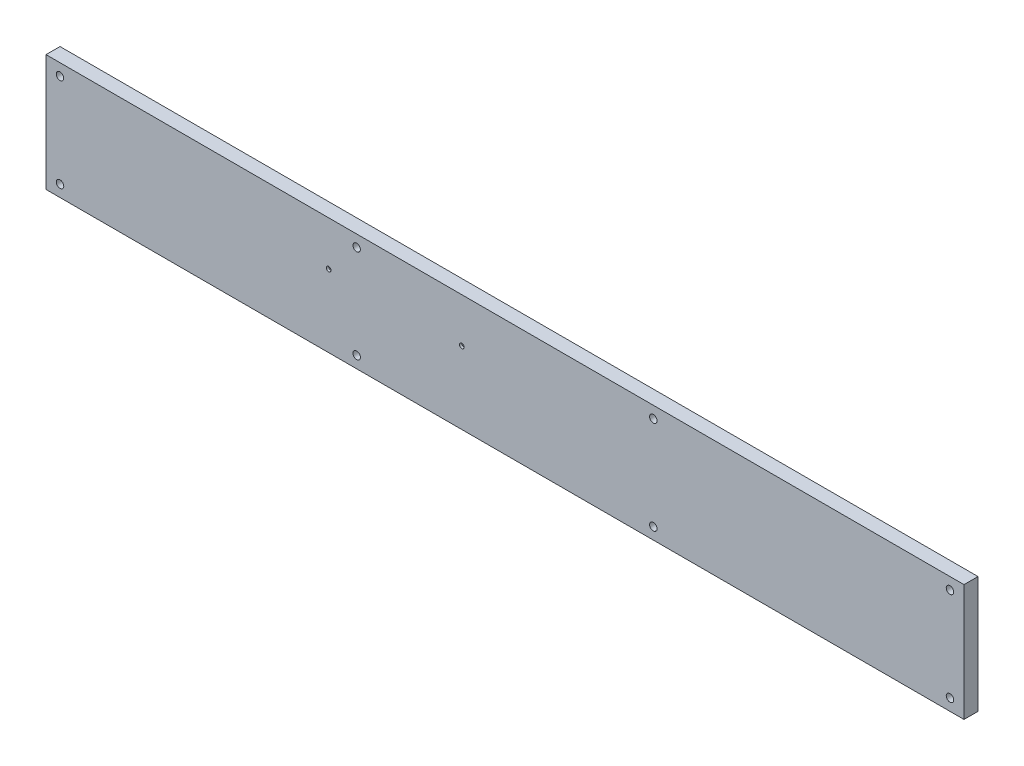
ISO-10303-21;
HEADER;
FILE_DESCRIPTION(('STEP AP214'),'2;1');
FILE_NAME('part.step','',(''),(''),'','','');
FILE_SCHEMA(('AUTOMOTIVE_DESIGN { 1 0 10303 214 1 1 1 1 }'));
ENDSEC;
DATA;
#1=APPLICATION_CONTEXT('core data for automotive mechanical design processes');
#2=APPLICATION_PROTOCOL_DEFINITION('international standard','automotive_design',2000,#1);
#3=PRODUCT_CONTEXT('',#1,'mechanical');
#4=PRODUCT('Part','Part','',(#3));
#5=PRODUCT_RELATED_PRODUCT_CATEGORY('part','',(#4));
#6=PRODUCT_DEFINITION_FORMATION('','',#4);
#7=PRODUCT_DEFINITION_CONTEXT('part definition',#1,'design');
#8=PRODUCT_DEFINITION('design','',#6,#7);
#9=PRODUCT_DEFINITION_SHAPE('','',#8);
#10=(LENGTH_UNIT() NAMED_UNIT(*) SI_UNIT(.MILLI.,.METRE.));
#11=(NAMED_UNIT(*) PLANE_ANGLE_UNIT() SI_UNIT($,.RADIAN.));
#12=(NAMED_UNIT(*) SI_UNIT($,.STERADIAN.) SOLID_ANGLE_UNIT());
#13=UNCERTAINTY_MEASURE_WITH_UNIT(LENGTH_MEASURE(1.E-05),#10,'distance_accuracy_value','');
#14=(GEOMETRIC_REPRESENTATION_CONTEXT(3) GLOBAL_UNCERTAINTY_ASSIGNED_CONTEXT((#13)) GLOBAL_UNIT_ASSIGNED_CONTEXT((#10,
#11,#12)) REPRESENTATION_CONTEXT('',''));
#15=CARTESIAN_POINT('',(0.,0.,0.));
#16=DIRECTION('',(0.,0.,1.));
#17=DIRECTION('',(1.,0.,0.));
#18=AXIS2_PLACEMENT_3D('',#15,#16,#17);
#19=CARTESIAN_POINT('',(0.,49.9999999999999,6.));
#20=DIRECTION('',(0.,0.,-1.));
#21=DIRECTION('',(-1.,0.,0.));
#22=AXIS2_PLACEMENT_3D('',#19,#20,#21);
#23=PLANE('',#22);
#24=CARTESIAN_POINT('',(178.,31.,6.));
#25=DIRECTION('',(0.,0.,1.));
#26=DIRECTION('',(1.,0.,0.));
#27=AXIS2_PLACEMENT_3D('',#24,#25,#26);
#28=CIRCLE('',#27,0.999999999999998);
#29=CARTESIAN_POINT('',(179.,31.,6.));
#30=VERTEX_POINT('',#29);
#31=EDGE_CURVE('E324',#30,#30,#28,.T.);
#32=ORIENTED_EDGE('',*,*,#31,.F.);
#33=EDGE_LOOP('',(#32));
#34=FACE_BOUND('',#33,.T.);
#35=CARTESIAN_POINT('',(121.,31.,6.));
#36=DIRECTION('',(0.,0.,1.));
#37=DIRECTION('',(1.,0.,0.));
#38=AXIS2_PLACEMENT_3D('',#35,#36,#37);
#39=CIRCLE('',#38,0.999999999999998);
#40=CARTESIAN_POINT('',(122.,31.,6.));
#41=VERTEX_POINT('',#40);
#42=EDGE_CURVE('E323',#41,#41,#39,.T.);
#43=ORIENTED_EDGE('',*,*,#42,.F.);
#44=EDGE_LOOP('',(#43));
#45=FACE_BOUND('',#44,.T.);
#46=CARTESIAN_POINT('',(260.,45.,6.));
#47=DIRECTION('',(0.,0.,1.));
#48=DIRECTION('',(-1.,0.,0.));
#49=AXIS2_PLACEMENT_3D('',#46,#47,#48);
#50=CIRCLE('',#49,1.60000000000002);
#51=CARTESIAN_POINT('',(258.4,45.,6.));
#52=VERTEX_POINT('',#51);
#53=EDGE_CURVE('E131',#52,#52,#50,.T.);
#54=ORIENTED_EDGE('',*,*,#53,.F.);
#55=EDGE_LOOP('',(#54));
#56=FACE_BOUND('',#55,.T.);
#57=CARTESIAN_POINT('',(387.,5.,6.));
#58=DIRECTION('',(0.,0.,1.));
#59=DIRECTION('',(1.,0.,0.));
#60=AXIS2_PLACEMENT_3D('',#57,#58,#59);
#61=CIRCLE('',#60,1.60000000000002);
#62=CARTESIAN_POINT('',(388.6,5.,6.));
#63=VERTEX_POINT('',#62);
#64=EDGE_CURVE('E147',#63,#63,#61,.T.);
#65=ORIENTED_EDGE('',*,*,#64,.F.);
#66=EDGE_LOOP('',(#65));
#67=FACE_BOUND('',#66,.T.);
#68=CARTESIAN_POINT('',(6.,5.,6.));
#69=DIRECTION('',(0.,0.,1.));
#70=DIRECTION('',(1.,0.,0.));
#71=AXIS2_PLACEMENT_3D('',#68,#69,#70);
#72=CIRCLE('',#71,1.6);
#73=CARTESIAN_POINT('',(7.6,5.,6.));
#74=VERTEX_POINT('',#73);
#75=EDGE_CURVE('E157',#74,#74,#72,.T.);
#76=ORIENTED_EDGE('',*,*,#75,.F.);
#77=EDGE_LOOP('',(#76));
#78=FACE_BOUND('',#77,.T.);
#79=CARTESIAN_POINT('',(6.,45.,6.));
#80=DIRECTION('',(0.,0.,1.));
#81=DIRECTION('',(-1.,0.,0.));
#82=AXIS2_PLACEMENT_3D('',#79,#80,#81);
#83=CIRCLE('',#82,1.6);
#84=CARTESIAN_POINT('',(4.4,45.,6.));
#85=VERTEX_POINT('',#84);
#86=EDGE_CURVE('E85',#85,#85,#83,.T.);
#87=ORIENTED_EDGE('',*,*,#86,.F.);
#88=EDGE_LOOP('',(#87));
#89=FACE_BOUND('',#88,.T.);
#90=DIRECTION('',(0.,-1.,0.));
#91=VECTOR('',#90,1.);
#92=CARTESIAN_POINT('',(0.,0.,6.));
#93=LINE('',#92,#91);
#94=CARTESIAN_POINT('',(0.,49.9999999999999,6.));
#95=VERTEX_POINT('',#94);
#96=CARTESIAN_POINT('',(0.,0.,6.));
#97=VERTEX_POINT('',#96);
#98=EDGE_CURVE('E95',#95,#97,#93,.T.);
#99=ORIENTED_EDGE('',*,*,#98,.T.);
#100=DIRECTION('',(1.,0.,0.));
#101=VECTOR('',#100,1.);
#102=CARTESIAN_POINT('',(0.,0.,6.));
#103=LINE('',#102,#101);
#104=CARTESIAN_POINT('',(393.,0.,6.));
#105=VERTEX_POINT('',#104);
#106=EDGE_CURVE('E80',#97,#105,#103,.T.);
#107=ORIENTED_EDGE('',*,*,#106,.T.);
#108=DIRECTION('',(0.,1.,0.));
#109=VECTOR('',#108,1.);
#110=CARTESIAN_POINT('',(393.,0.,6.));
#111=LINE('',#110,#109);
#112=CARTESIAN_POINT('',(393.,49.9999999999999,6.));
#113=VERTEX_POINT('',#112);
#114=EDGE_CURVE('E46',#105,#113,#111,.T.);
#115=ORIENTED_EDGE('',*,*,#114,.T.);
#116=DIRECTION('',(-1.,0.,0.));
#117=VECTOR('',#116,1.);
#118=CARTESIAN_POINT('',(0.,49.9999999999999,6.));
#119=LINE('',#118,#117);
#120=EDGE_CURVE('E41',#113,#95,#119,.T.);
#121=ORIENTED_EDGE('',*,*,#120,.T.);
#122=EDGE_LOOP('',(#99,#107,#115,#121));
#123=FACE_BOUND('',#122,.T.);
#124=CARTESIAN_POINT('',(133.,5.,6.));
#125=DIRECTION('',(0.,0.,1.));
#126=DIRECTION('',(1.,0.,0.));
#127=AXIS2_PLACEMENT_3D('',#124,#125,#126);
#128=CIRCLE('',#127,1.59999999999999);
#129=CARTESIAN_POINT('',(134.6,5.,6.));
#130=VERTEX_POINT('',#129);
#131=EDGE_CURVE('E114',#130,#130,#128,.T.);
#132=ORIENTED_EDGE('',*,*,#131,.F.);
#133=EDGE_LOOP('',(#132));
#134=FACE_BOUND('',#133,.T.);
#135=CARTESIAN_POINT('',(260.,5.,6.));
#136=DIRECTION('',(0.,0.,1.));
#137=DIRECTION('',(1.,0.,0.));
#138=AXIS2_PLACEMENT_3D('',#135,#136,#137);
#139=CIRCLE('',#138,1.60000000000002);
#140=CARTESIAN_POINT('',(261.6,5.,6.));
#141=VERTEX_POINT('',#140);
#142=EDGE_CURVE('E118',#141,#141,#139,.T.);
#143=ORIENTED_EDGE('',*,*,#142,.F.);
#144=EDGE_LOOP('',(#143));
#145=FACE_BOUND('',#144,.T.);
#146=CARTESIAN_POINT('',(133.,45.,6.));
#147=DIRECTION('',(0.,0.,1.));
#148=DIRECTION('',(-1.,0.,0.));
#149=AXIS2_PLACEMENT_3D('',#146,#147,#148);
#150=CIRCLE('',#149,1.59999999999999);
#151=CARTESIAN_POINT('',(131.4,45.,6.));
#152=VERTEX_POINT('',#151);
#153=EDGE_CURVE('E122',#152,#152,#150,.T.);
#154=ORIENTED_EDGE('',*,*,#153,.F.);
#155=EDGE_LOOP('',(#154));
#156=FACE_BOUND('',#155,.T.);
#157=CARTESIAN_POINT('',(387.,45.,6.));
#158=DIRECTION('',(0.,0.,1.));
#159=DIRECTION('',(-1.,0.,0.));
#160=AXIS2_PLACEMENT_3D('',#157,#158,#159);
#161=CIRCLE('',#160,1.60000000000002);
#162=CARTESIAN_POINT('',(385.4,45.,6.));
#163=VERTEX_POINT('',#162);
#164=EDGE_CURVE('E125',#163,#163,#161,.T.);
#165=ORIENTED_EDGE('',*,*,#164,.F.);
#166=EDGE_LOOP('',(#165));
#167=FACE_BOUND('',#166,.T.);
#168=ADVANCED_FACE('F26',(#34,#45,#56,#67,#78,#89,#123,#134,#145,#156,#167),#23,.F.);
#169=CARTESIAN_POINT('',(0.,49.9999999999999,0.));
#170=DIRECTION('',(0.,0.,-1.));
#171=DIRECTION('',(-1.,0.,0.));
#172=AXIS2_PLACEMENT_3D('',#169,#170,#171);
#173=PLANE('',#172);
#174=CARTESIAN_POINT('',(260.,45.,0.));
#175=DIRECTION('',(0.,0.,1.));
#176=DIRECTION('',(-1.,0.,0.));
#177=AXIS2_PLACEMENT_3D('',#174,#175,#176);
#178=CIRCLE('',#177,1.60000000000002);
#179=CARTESIAN_POINT('',(258.4,45.,0.));
#180=VERTEX_POINT('',#179);
#181=EDGE_CURVE('E127',#180,#180,#178,.T.);
#182=ORIENTED_EDGE('',*,*,#181,.T.);
#183=EDGE_LOOP('',(#182));
#184=FACE_BOUND('',#183,.T.);
#185=CARTESIAN_POINT('',(387.,5.,0.));
#186=DIRECTION('',(0.,0.,1.));
#187=DIRECTION('',(1.,0.,0.));
#188=AXIS2_PLACEMENT_3D('',#185,#186,#187);
#189=CIRCLE('',#188,1.60000000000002);
#190=CARTESIAN_POINT('',(388.6,5.,0.));
#191=VERTEX_POINT('',#190);
#192=EDGE_CURVE('E144',#191,#191,#189,.T.);
#193=ORIENTED_EDGE('',*,*,#192,.T.);
#194=EDGE_LOOP('',(#193));
#195=FACE_BOUND('',#194,.T.);
#196=CARTESIAN_POINT('',(6.,5.,0.));
#197=DIRECTION('',(0.,0.,1.));
#198=DIRECTION('',(1.,0.,0.));
#199=AXIS2_PLACEMENT_3D('',#196,#197,#198);
#200=CIRCLE('',#199,1.6);
#201=CARTESIAN_POINT('',(7.6,5.,0.));
#202=VERTEX_POINT('',#201);
#203=EDGE_CURVE('E154',#202,#202,#200,.T.);
#204=ORIENTED_EDGE('',*,*,#203,.T.);
#205=EDGE_LOOP('',(#204));
#206=FACE_BOUND('',#205,.T.);
#207=CARTESIAN_POINT('',(6.,45.,0.));
#208=DIRECTION('',(0.,0.,1.));
#209=DIRECTION('',(-1.,0.,0.));
#210=AXIS2_PLACEMENT_3D('',#207,#208,#209);
#211=CIRCLE('',#210,1.6);
#212=CARTESIAN_POINT('',(4.4,45.,0.));
#213=VERTEX_POINT('',#212);
#214=EDGE_CURVE('E88',#213,#213,#211,.T.);
#215=ORIENTED_EDGE('',*,*,#214,.T.);
#216=EDGE_LOOP('',(#215));
#217=FACE_BOUND('',#216,.T.);
#218=DIRECTION('',(0.,-1.,0.));
#219=VECTOR('',#218,1.);
#220=CARTESIAN_POINT('',(0.,0.,0.));
#221=LINE('',#220,#219);
#222=CARTESIAN_POINT('',(0.,49.9999999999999,0.));
#223=VERTEX_POINT('',#222);
#224=CARTESIAN_POINT('',(0.,0.,0.));
#225=VERTEX_POINT('',#224);
#226=EDGE_CURVE('E72',#223,#225,#221,.T.);
#227=ORIENTED_EDGE('',*,*,#226,.F.);
#228=DIRECTION('',(-1.,0.,0.));
#229=VECTOR('',#228,1.);
#230=CARTESIAN_POINT('',(0.,49.9999999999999,0.));
#231=LINE('',#230,#229);
#232=CARTESIAN_POINT('',(393.,49.9999999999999,0.));
#233=VERTEX_POINT('',#232);
#234=EDGE_CURVE('E93',#233,#223,#231,.T.);
#235=ORIENTED_EDGE('',*,*,#234,.F.);
#236=DIRECTION('',(0.,1.,0.));
#237=VECTOR('',#236,1.);
#238=CARTESIAN_POINT('',(393.,0.,0.));
#239=LINE('',#238,#237);
#240=CARTESIAN_POINT('',(393.,0.,0.));
#241=VERTEX_POINT('',#240);
#242=EDGE_CURVE('E73',#241,#233,#239,.T.);
#243=ORIENTED_EDGE('',*,*,#242,.F.);
#244=DIRECTION('',(1.,0.,0.));
#245=VECTOR('',#244,1.);
#246=CARTESIAN_POINT('',(0.,0.,0.));
#247=LINE('',#246,#245);
#248=EDGE_CURVE('E67',#225,#241,#247,.T.);
#249=ORIENTED_EDGE('',*,*,#248,.F.);
#250=EDGE_LOOP('',(#227,#235,#243,#249));
#251=FACE_BOUND('',#250,.T.);
#252=CARTESIAN_POINT('',(133.,5.,0.));
#253=DIRECTION('',(0.,0.,1.));
#254=DIRECTION('',(1.,0.,0.));
#255=AXIS2_PLACEMENT_3D('',#252,#253,#254);
#256=CIRCLE('',#255,1.59999999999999);
#257=CARTESIAN_POINT('',(134.6,5.,0.));
#258=VERTEX_POINT('',#257);
#259=EDGE_CURVE('E160',#258,#258,#256,.T.);
#260=ORIENTED_EDGE('',*,*,#259,.T.);
#261=EDGE_LOOP('',(#260));
#262=FACE_BOUND('',#261,.T.);
#263=CARTESIAN_POINT('',(260.,5.,0.));
#264=DIRECTION('',(0.,0.,1.));
#265=DIRECTION('',(1.,0.,0.));
#266=AXIS2_PLACEMENT_3D('',#263,#264,#265);
#267=CIRCLE('',#266,1.60000000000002);
#268=CARTESIAN_POINT('',(261.6,5.,0.));
#269=VERTEX_POINT('',#268);
#270=EDGE_CURVE('E150',#269,#269,#267,.T.);
#271=ORIENTED_EDGE('',*,*,#270,.T.);
#272=EDGE_LOOP('',(#271));
#273=FACE_BOUND('',#272,.T.);
#274=CARTESIAN_POINT('',(133.,45.,0.));
#275=DIRECTION('',(0.,0.,1.));
#276=DIRECTION('',(-1.,0.,0.));
#277=AXIS2_PLACEMENT_3D('',#274,#275,#276);
#278=CIRCLE('',#277,1.59999999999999);
#279=CARTESIAN_POINT('',(131.4,45.,0.));
#280=VERTEX_POINT('',#279);
#281=EDGE_CURVE('E140',#280,#280,#278,.T.);
#282=ORIENTED_EDGE('',*,*,#281,.T.);
#283=EDGE_LOOP('',(#282));
#284=FACE_BOUND('',#283,.T.);
#285=CARTESIAN_POINT('',(387.,45.,0.));
#286=DIRECTION('',(0.,0.,1.));
#287=DIRECTION('',(-1.,0.,0.));
#288=AXIS2_PLACEMENT_3D('',#285,#286,#287);
#289=CIRCLE('',#288,1.60000000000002);
#290=CARTESIAN_POINT('',(385.4,45.,0.));
#291=VERTEX_POINT('',#290);
#292=EDGE_CURVE('E128',#291,#291,#289,.T.);
#293=ORIENTED_EDGE('',*,*,#292,.T.);
#294=EDGE_LOOP('',(#293));
#295=FACE_BOUND('',#294,.T.);
#296=ADVANCED_FACE('F68',(#184,#195,#206,#217,#251,#262,#273,#284,#295),#173,.T.);
#297=CARTESIAN_POINT('',(0.,0.,6.));
#298=DIRECTION('',(1.,0.,0.));
#299=DIRECTION('',(0.,0.,-1.));
#300=AXIS2_PLACEMENT_3D('',#297,#298,#299);
#301=PLANE('',#300);
#302=ORIENTED_EDGE('',*,*,#226,.T.);
#303=DIRECTION('',(0.,0.,-1.));
#304=VECTOR('',#303,1.);
#305=CARTESIAN_POINT('',(0.,0.,6.));
#306=LINE('',#305,#304);
#307=EDGE_CURVE('E11',#97,#225,#306,.T.);
#308=ORIENTED_EDGE('',*,*,#307,.F.);
#309=ORIENTED_EDGE('',*,*,#98,.F.);
#310=DIRECTION('',(0.,0.,-1.));
#311=VECTOR('',#310,1.);
#312=CARTESIAN_POINT('',(0.,49.9999999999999,6.));
#313=LINE('',#312,#311);
#314=EDGE_CURVE('E84',#95,#223,#313,.T.);
#315=ORIENTED_EDGE('',*,*,#314,.T.);
#316=EDGE_LOOP('',(#302,#308,#309,#315));
#317=FACE_BOUND('',#316,.T.);
#318=ADVANCED_FACE('F28',(#317),#301,.F.);
#319=CARTESIAN_POINT('',(0.,0.,6.));
#320=DIRECTION('',(0.,1.,0.));
#321=DIRECTION('',(0.,0.,1.));
#322=AXIS2_PLACEMENT_3D('',#319,#320,#321);
#323=PLANE('',#322);
#324=ORIENTED_EDGE('',*,*,#248,.T.);
#325=DIRECTION('',(0.,0.,-1.));
#326=VECTOR('',#325,1.);
#327=CARTESIAN_POINT('',(393.,0.,6.));
#328=LINE('',#327,#326);
#329=EDGE_CURVE('E34',#105,#241,#328,.T.);
#330=ORIENTED_EDGE('',*,*,#329,.F.);
#331=ORIENTED_EDGE('',*,*,#106,.F.);
#332=ORIENTED_EDGE('',*,*,#307,.T.);
#333=EDGE_LOOP('',(#324,#330,#331,#332));
#334=FACE_BOUND('',#333,.T.);
#335=ADVANCED_FACE('F79',(#334),#323,.F.);
#336=CARTESIAN_POINT('',(393.,0.,6.));
#337=DIRECTION('',(-1.,0.,0.));
#338=DIRECTION('',(0.,0.,1.));
#339=AXIS2_PLACEMENT_3D('',#336,#337,#338);
#340=PLANE('',#339);
#341=ORIENTED_EDGE('',*,*,#242,.T.);
#342=DIRECTION('',(0.,0.,-1.));
#343=VECTOR('',#342,1.);
#344=CARTESIAN_POINT('',(393.,49.9999999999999,6.));
#345=LINE('',#344,#343);
#346=EDGE_CURVE('E101',#113,#233,#345,.T.);
#347=ORIENTED_EDGE('',*,*,#346,.F.);
#348=ORIENTED_EDGE('',*,*,#114,.F.);
#349=ORIENTED_EDGE('',*,*,#329,.T.);
#350=EDGE_LOOP('',(#341,#347,#348,#349));
#351=FACE_BOUND('',#350,.T.);
#352=ADVANCED_FACE('F104',(#351),#340,.F.);
#353=CARTESIAN_POINT('',(0.,49.9999999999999,6.));
#354=DIRECTION('',(0.,-1.,0.));
#355=DIRECTION('',(0.,0.,-1.));
#356=AXIS2_PLACEMENT_3D('',#353,#354,#355);
#357=PLANE('',#356);
#358=ORIENTED_EDGE('',*,*,#234,.T.);
#359=ORIENTED_EDGE('',*,*,#314,.F.);
#360=ORIENTED_EDGE('',*,*,#120,.F.);
#361=ORIENTED_EDGE('',*,*,#346,.T.);
#362=EDGE_LOOP('',(#358,#359,#360,#361));
#363=FACE_BOUND('',#362,.T.);
#364=ADVANCED_FACE('F106',(#363),#357,.F.);
#365=CARTESIAN_POINT('',(6.,45.,6.));
#366=DIRECTION('',(0.,0.,-1.));
#367=DIRECTION('',(-1.,0.,0.));
#368=AXIS2_PLACEMENT_3D('',#365,#366,#367);
#369=CYLINDRICAL_SURFACE('',#368,1.6);
#370=ORIENTED_EDGE('',*,*,#86,.T.);
#371=EDGE_LOOP('',(#370));
#372=FACE_BOUND('',#371,.T.);
#373=ORIENTED_EDGE('',*,*,#214,.F.);
#374=EDGE_LOOP('',(#373));
#375=FACE_BOUND('',#374,.T.);
#376=ADVANCED_FACE('F167',(#372,#375),#369,.F.);
#377=CARTESIAN_POINT('',(133.,5.,6.));
#378=DIRECTION('',(0.,0.,-1.));
#379=DIRECTION('',(-1.,0.,0.));
#380=AXIS2_PLACEMENT_3D('',#377,#378,#379);
#381=CYLINDRICAL_SURFACE('',#380,1.59999999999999);
#382=ORIENTED_EDGE('',*,*,#131,.T.);
#383=EDGE_LOOP('',(#382));
#384=FACE_BOUND('',#383,.T.);
#385=ORIENTED_EDGE('',*,*,#259,.F.);
#386=EDGE_LOOP('',(#385));
#387=FACE_BOUND('',#386,.T.);
#388=ADVANCED_FACE('F169',(#384,#387),#381,.F.);
#389=CARTESIAN_POINT('',(6.,5.,6.));
#390=DIRECTION('',(0.,0.,-1.));
#391=DIRECTION('',(-1.,0.,0.));
#392=AXIS2_PLACEMENT_3D('',#389,#390,#391);
#393=CYLINDRICAL_SURFACE('',#392,1.6);
#394=ORIENTED_EDGE('',*,*,#75,.T.);
#395=EDGE_LOOP('',(#394));
#396=FACE_BOUND('',#395,.T.);
#397=ORIENTED_EDGE('',*,*,#203,.F.);
#398=EDGE_LOOP('',(#397));
#399=FACE_BOUND('',#398,.T.);
#400=ADVANCED_FACE('F176',(#396,#399),#393,.F.);
#401=CARTESIAN_POINT('',(260.,5.,6.));
#402=DIRECTION('',(0.,0.,-1.));
#403=DIRECTION('',(-1.,0.,0.));
#404=AXIS2_PLACEMENT_3D('',#401,#402,#403);
#405=CYLINDRICAL_SURFACE('',#404,1.60000000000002);
#406=ORIENTED_EDGE('',*,*,#142,.T.);
#407=EDGE_LOOP('',(#406));
#408=FACE_BOUND('',#407,.T.);
#409=ORIENTED_EDGE('',*,*,#270,.F.);
#410=EDGE_LOOP('',(#409));
#411=FACE_BOUND('',#410,.T.);
#412=ADVANCED_FACE('F252',(#408,#411),#405,.F.);
#413=CARTESIAN_POINT('',(387.,5.,6.));
#414=DIRECTION('',(0.,0.,-1.));
#415=DIRECTION('',(-1.,0.,0.));
#416=AXIS2_PLACEMENT_3D('',#413,#414,#415);
#417=CYLINDRICAL_SURFACE('',#416,1.60000000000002);
#418=ORIENTED_EDGE('',*,*,#64,.T.);
#419=EDGE_LOOP('',(#418));
#420=FACE_BOUND('',#419,.T.);
#421=ORIENTED_EDGE('',*,*,#192,.F.);
#422=EDGE_LOOP('',(#421));
#423=FACE_BOUND('',#422,.T.);
#424=ADVANCED_FACE('F248',(#420,#423),#417,.F.);
#425=CARTESIAN_POINT('',(133.,45.,6.));
#426=DIRECTION('',(0.,0.,-1.));
#427=DIRECTION('',(-1.,0.,0.));
#428=AXIS2_PLACEMENT_3D('',#425,#426,#427);
#429=CYLINDRICAL_SURFACE('',#428,1.59999999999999);
#430=ORIENTED_EDGE('',*,*,#153,.T.);
#431=EDGE_LOOP('',(#430));
#432=FACE_BOUND('',#431,.T.);
#433=ORIENTED_EDGE('',*,*,#281,.F.);
#434=EDGE_LOOP('',(#433));
#435=FACE_BOUND('',#434,.T.);
#436=ADVANCED_FACE('F244',(#432,#435),#429,.F.);
#437=CARTESIAN_POINT('',(260.,45.,6.));
#438=DIRECTION('',(0.,0.,-1.));
#439=DIRECTION('',(-1.,0.,0.));
#440=AXIS2_PLACEMENT_3D('',#437,#438,#439);
#441=CYLINDRICAL_SURFACE('',#440,1.60000000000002);
#442=ORIENTED_EDGE('',*,*,#53,.T.);
#443=EDGE_LOOP('',(#442));
#444=FACE_BOUND('',#443,.T.);
#445=ORIENTED_EDGE('',*,*,#181,.F.);
#446=EDGE_LOOP('',(#445));
#447=FACE_BOUND('',#446,.T.);
#448=ADVANCED_FACE('F242',(#444,#447),#441,.F.);
#449=CARTESIAN_POINT('',(387.,45.,6.));
#450=DIRECTION('',(0.,0.,-1.));
#451=DIRECTION('',(-1.,0.,0.));
#452=AXIS2_PLACEMENT_3D('',#449,#450,#451);
#453=CYLINDRICAL_SURFACE('',#452,1.60000000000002);
#454=ORIENTED_EDGE('',*,*,#164,.T.);
#455=EDGE_LOOP('',(#454));
#456=FACE_BOUND('',#455,.T.);
#457=ORIENTED_EDGE('',*,*,#292,.F.);
#458=EDGE_LOOP('',(#457));
#459=FACE_BOUND('',#458,.T.);
#460=ADVANCED_FACE('F204',(#456,#459),#453,.F.);
#461=CARTESIAN_POINT('',(121.,31.,5.));
#462=DIRECTION('',(0.,0.,1.));
#463=DIRECTION('',(1.,0.,0.));
#464=AXIS2_PLACEMENT_3D('',#461,#462,#463);
#465=CYLINDRICAL_SURFACE('',#464,0.999999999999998);
#466=CARTESIAN_POINT('',(121.,31.,5.));
#467=DIRECTION('',(0.,0.,1.));
#468=DIRECTION('',(1.,0.,0.));
#469=AXIS2_PLACEMENT_3D('',#466,#467,#468);
#470=CIRCLE('',#469,0.999999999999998);
#471=CARTESIAN_POINT('',(122.,31.,5.));
#472=VERTEX_POINT('',#471);
#473=EDGE_CURVE('E134',#472,#472,#470,.T.);
#474=ORIENTED_EDGE('',*,*,#473,.F.);
#475=EDGE_LOOP('',(#474));
#476=FACE_BOUND('',#475,.T.);
#477=ORIENTED_EDGE('',*,*,#42,.T.);
#478=EDGE_LOOP('',(#477));
#479=FACE_BOUND('',#478,.T.);
#480=ADVANCED_FACE('F208',(#476,#479),#465,.F.);
#481=CARTESIAN_POINT('',(121.,31.,5.));
#482=DIRECTION('',(0.,0.,1.));
#483=DIRECTION('',(1.,0.,0.));
#484=AXIS2_PLACEMENT_3D('',#481,#482,#483);
#485=PLANE('',#484);
#486=ORIENTED_EDGE('',*,*,#473,.T.);
#487=EDGE_LOOP('',(#486));
#488=FACE_BOUND('',#487,.T.);
#489=ADVANCED_FACE('F212',(#488),#485,.T.);
#490=CARTESIAN_POINT('',(178.,31.,5.));
#491=DIRECTION('',(0.,0.,1.));
#492=DIRECTION('',(1.,0.,0.));
#493=AXIS2_PLACEMENT_3D('',#490,#491,#492);
#494=CYLINDRICAL_SURFACE('',#493,0.999999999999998);
#495=CARTESIAN_POINT('',(178.,31.,5.));
#496=DIRECTION('',(0.,0.,1.));
#497=DIRECTION('',(1.,0.,0.));
#498=AXIS2_PLACEMENT_3D('',#495,#496,#497);
#499=CIRCLE('',#498,0.999999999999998);
#500=CARTESIAN_POINT('',(179.,31.,5.));
#501=VERTEX_POINT('',#500);
#502=EDGE_CURVE('E322',#501,#501,#499,.T.);
#503=ORIENTED_EDGE('',*,*,#502,.F.);
#504=EDGE_LOOP('',(#503));
#505=FACE_BOUND('',#504,.T.);
#506=ORIENTED_EDGE('',*,*,#31,.T.);
#507=EDGE_LOOP('',(#506));
#508=FACE_BOUND('',#507,.T.);
#509=ADVANCED_FACE('F220',(#505,#508),#494,.F.);
#510=CARTESIAN_POINT('',(178.,31.,5.));
#511=DIRECTION('',(0.,0.,1.));
#512=DIRECTION('',(1.,0.,0.));
#513=AXIS2_PLACEMENT_3D('',#510,#511,#512);
#514=PLANE('',#513);
#515=ORIENTED_EDGE('',*,*,#502,.T.);
#516=EDGE_LOOP('',(#515));
#517=FACE_BOUND('',#516,.T.);
#518=ADVANCED_FACE('F228',(#517),#514,.T.);
#519=CLOSED_SHELL('',(#168,#296,#318,#335,#352,#364,#376,#388,#400,#412,#424,#436,#448,#460,
#480,#489,#509,#518));
#520=MANIFOLD_SOLID_BREP('B2',#519);
#521=ADVANCED_BREP_SHAPE_REPRESENTATION('',(#18,#520),#14);
#522=SHAPE_DEFINITION_REPRESENTATION(#9,#521);
ENDSEC;
END-ISO-10303-21;
